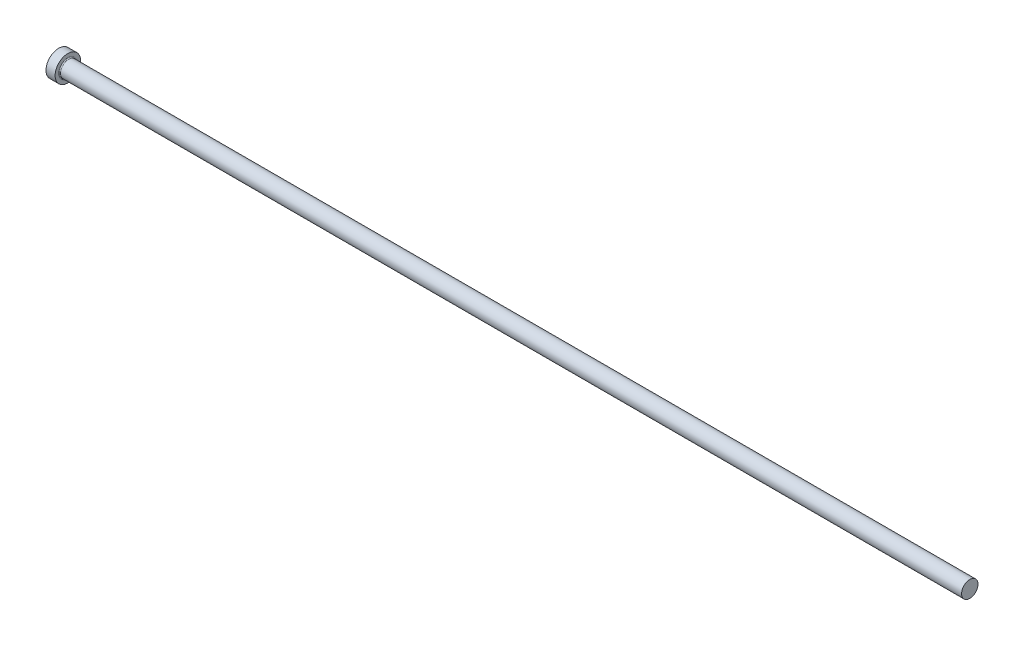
ISO-10303-21;
HEADER;
FILE_DESCRIPTION(('STEP AP214'),'2;1');
FILE_NAME('part.step','',(''),(''),'','','');
FILE_SCHEMA(('AUTOMOTIVE_DESIGN { 1 0 10303 214 1 1 1 1 }'));
ENDSEC;
DATA;
#1=APPLICATION_CONTEXT('core data for automotive mechanical design processes');
#2=APPLICATION_PROTOCOL_DEFINITION('international standard','automotive_design',2000,#1);
#3=PRODUCT_CONTEXT('',#1,'mechanical');
#4=PRODUCT('Part','Part','',(#3));
#5=PRODUCT_RELATED_PRODUCT_CATEGORY('part','',(#4));
#6=PRODUCT_DEFINITION_FORMATION('','',#4);
#7=PRODUCT_DEFINITION_CONTEXT('part definition',#1,'design');
#8=PRODUCT_DEFINITION('design','',#6,#7);
#9=PRODUCT_DEFINITION_SHAPE('','',#8);
#10=(LENGTH_UNIT() NAMED_UNIT(*) SI_UNIT(.MILLI.,.METRE.));
#11=(NAMED_UNIT(*) PLANE_ANGLE_UNIT() SI_UNIT($,.RADIAN.));
#12=(NAMED_UNIT(*) SI_UNIT($,.STERADIAN.) SOLID_ANGLE_UNIT());
#13=UNCERTAINTY_MEASURE_WITH_UNIT(LENGTH_MEASURE(1.E-05),#10,'distance_accuracy_value','');
#14=(GEOMETRIC_REPRESENTATION_CONTEXT(3) GLOBAL_UNCERTAINTY_ASSIGNED_CONTEXT((#13)) GLOBAL_UNIT_ASSIGNED_CONTEXT((#10,
#11,#12)) REPRESENTATION_CONTEXT('',''));
#15=CARTESIAN_POINT('',(0.,0.,0.));
#16=DIRECTION('',(0.,0.,1.));
#17=DIRECTION('',(1.,0.,0.));
#18=AXIS2_PLACEMENT_3D('',#15,#16,#17);
#19=CARTESIAN_POINT('',(0.,0.,0.));
#20=DIRECTION('',(-1.,0.,0.));
#21=DIRECTION('',(0.,-1.,0.));
#22=AXIS2_PLACEMENT_3D('',#19,#20,#21);
#23=PLANE('',#22);
#24=CARTESIAN_POINT('',(0.,0.,0.));
#25=DIRECTION('',(1.,0.,0.));
#26=DIRECTION('',(0.,1.,0.));
#27=AXIS2_PLACEMENT_3D('',#24,#25,#26);
#28=CIRCLE('',#27,7.);
#29=CARTESIAN_POINT('',(0.,7.,0.));
#30=VERTEX_POINT('',#29);
#31=EDGE_CURVE('E25',#30,#30,#28,.T.);
#32=ORIENTED_EDGE('',*,*,#31,.F.);
#33=EDGE_LOOP('',(#32));
#34=FACE_BOUND('',#33,.T.);
#35=ADVANCED_FACE('F14',(#34),#23,.T.);
#36=CARTESIAN_POINT('',(500.,0.,0.));
#37=DIRECTION('',(1.,0.,0.));
#38=DIRECTION('',(0.,1.,0.));
#39=AXIS2_PLACEMENT_3D('',#36,#37,#38);
#40=CYLINDRICAL_SURFACE('',#39,7.);
#41=ORIENTED_EDGE('',*,*,#31,.T.);
#42=EDGE_LOOP('',(#41));
#43=FACE_BOUND('',#42,.T.);
#44=CARTESIAN_POINT('',(5.,0.,0.));
#45=DIRECTION('',(1.,0.,0.));
#46=DIRECTION('',(0.,1.,0.));
#47=AXIS2_PLACEMENT_3D('',#44,#45,#46);
#48=CIRCLE('',#47,7.);
#49=CARTESIAN_POINT('',(5.,7.,0.));
#50=VERTEX_POINT('',#49);
#51=EDGE_CURVE('E29',#50,#50,#48,.T.);
#52=ORIENTED_EDGE('',*,*,#51,.F.);
#53=EDGE_LOOP('',(#52));
#54=FACE_BOUND('',#53,.T.);
#55=ADVANCED_FACE('F51',(#43,#54),#40,.T.);
#56=CARTESIAN_POINT('',(5.,7.,0.));
#57=DIRECTION('',(1.,0.,0.));
#58=DIRECTION('',(0.,1.,0.));
#59=AXIS2_PLACEMENT_3D('',#56,#57,#58);
#60=PLANE('',#59);
#61=CARTESIAN_POINT('',(5.,0.,0.));
#62=DIRECTION('',(1.,0.,0.));
#63=DIRECTION('',(0.,1.,0.));
#64=AXIS2_PLACEMENT_3D('',#61,#62,#63);
#65=CIRCLE('',#64,4.99999999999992);
#66=CARTESIAN_POINT('',(5.,4.99999999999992,0.));
#67=VERTEX_POINT('',#66);
#68=EDGE_CURVE('E9',#67,#67,#65,.F.);
#69=ORIENTED_EDGE('',*,*,#68,.T.);
#70=EDGE_LOOP('',(#69));
#71=FACE_BOUND('',#70,.T.);
#72=ORIENTED_EDGE('',*,*,#51,.T.);
#73=EDGE_LOOP('',(#72));
#74=FACE_BOUND('',#73,.T.);
#75=ADVANCED_FACE('F42',(#71,#74),#60,.T.);
#76=CARTESIAN_POINT('',(500.,0.,0.));
#77=DIRECTION('',(1.,0.,0.));
#78=DIRECTION('',(0.,1.,0.));
#79=AXIS2_PLACEMENT_3D('',#76,#77,#78);
#80=CYLINDRICAL_SURFACE('',#79,4.49999999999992);
#81=CARTESIAN_POINT('',(5.5,0.,0.));
#82=DIRECTION('',(1.,0.,0.));
#83=DIRECTION('',(0.,1.,0.));
#84=AXIS2_PLACEMENT_3D('',#81,#82,#83);
#85=CIRCLE('',#84,4.49999999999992);
#86=CARTESIAN_POINT('',(5.5,4.49999999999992,0.));
#87=VERTEX_POINT('',#86);
#88=EDGE_CURVE('E21',#87,#87,#85,.T.);
#89=ORIENTED_EDGE('',*,*,#88,.T.);
#90=EDGE_LOOP('',(#89));
#91=FACE_BOUND('',#90,.T.);
#92=CARTESIAN_POINT('',(500.,0.,0.));
#93=DIRECTION('',(1.,0.,0.));
#94=DIRECTION('',(0.,1.,0.));
#95=AXIS2_PLACEMENT_3D('',#92,#93,#94);
#96=CIRCLE('',#95,4.49999999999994);
#97=CARTESIAN_POINT('',(500.,4.49999999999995,0.));
#98=VERTEX_POINT('',#97);
#99=EDGE_CURVE('E34',#98,#98,#96,.T.);
#100=ORIENTED_EDGE('',*,*,#99,.F.);
#101=EDGE_LOOP('',(#100));
#102=FACE_BOUND('',#101,.T.);
#103=ADVANCED_FACE('F40',(#91,#102),#80,.T.);
#104=CARTESIAN_POINT('',(500.,4.49999999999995,0.));
#105=DIRECTION('',(1.,0.,0.));
#106=DIRECTION('',(0.,1.,0.));
#107=AXIS2_PLACEMENT_3D('',#104,#105,#106);
#108=PLANE('',#107);
#109=ORIENTED_EDGE('',*,*,#99,.T.);
#110=EDGE_LOOP('',(#109));
#111=FACE_BOUND('',#110,.T.);
#112=ADVANCED_FACE('F38',(#111),#108,.T.);
#113=CARTESIAN_POINT('',(5.5,0.,0.));
#114=DIRECTION('',(1.,0.,0.));
#115=DIRECTION('',(0.,1.,0.));
#116=AXIS2_PLACEMENT_3D('',#113,#114,#115);
#117=TOROIDAL_SURFACE('',#116,4.99999999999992,0.5);
#118=ORIENTED_EDGE('',*,*,#68,.F.);
#119=EDGE_LOOP('',(#118));
#120=FACE_BOUND('',#119,.T.);
#121=ORIENTED_EDGE('',*,*,#88,.F.);
#122=EDGE_LOOP('',(#121));
#123=FACE_BOUND('',#122,.T.);
#124=ADVANCED_FACE('F16',(#120,#123),#117,.F.);
#125=CLOSED_SHELL('',(#35,#55,#75,#103,#112,#124));
#126=MANIFOLD_SOLID_BREP('B1',#125);
#127=ADVANCED_BREP_SHAPE_REPRESENTATION('',(#18,#126),#14);
#128=SHAPE_DEFINITION_REPRESENTATION(#9,#127);
ENDSEC;
END-ISO-10303-21;
